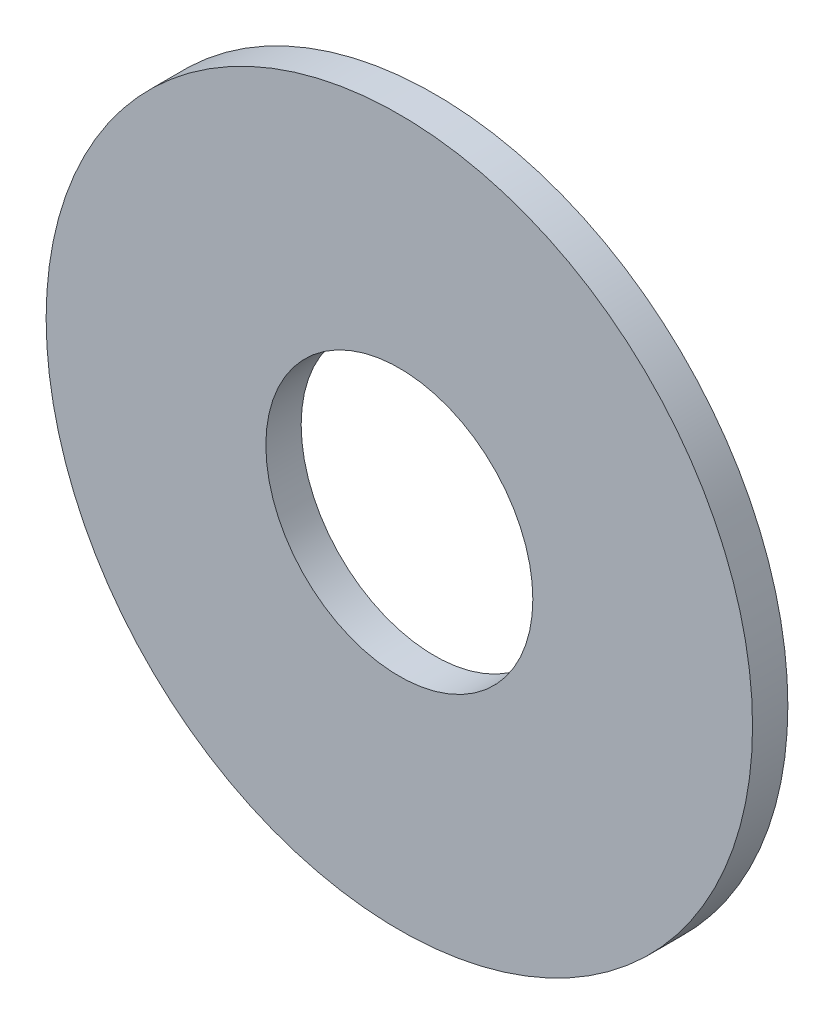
ISO-10303-21;
HEADER;
FILE_DESCRIPTION(('STEP AP214'),'2;1');
FILE_NAME('part.step','',(''),(''),'','','');
FILE_SCHEMA(('AUTOMOTIVE_DESIGN { 1 0 10303 214 1 1 1 1 }'));
ENDSEC;
DATA;
#1=APPLICATION_CONTEXT('core data for automotive mechanical design processes');
#2=APPLICATION_PROTOCOL_DEFINITION('international standard','automotive_design',2000,#1);
#3=PRODUCT_CONTEXT('',#1,'mechanical');
#4=PRODUCT('Part','Part','',(#3));
#5=PRODUCT_RELATED_PRODUCT_CATEGORY('part','',(#4));
#6=PRODUCT_DEFINITION_FORMATION('','',#4);
#7=PRODUCT_DEFINITION_CONTEXT('part definition',#1,'design');
#8=PRODUCT_DEFINITION('design','',#6,#7);
#9=PRODUCT_DEFINITION_SHAPE('','',#8);
#10=(LENGTH_UNIT() NAMED_UNIT(*) SI_UNIT(.MILLI.,.METRE.));
#11=(NAMED_UNIT(*) PLANE_ANGLE_UNIT() SI_UNIT($,.RADIAN.));
#12=(NAMED_UNIT(*) SI_UNIT($,.STERADIAN.) SOLID_ANGLE_UNIT());
#13=UNCERTAINTY_MEASURE_WITH_UNIT(LENGTH_MEASURE(1.E-05),#10,'distance_accuracy_value','');
#14=(GEOMETRIC_REPRESENTATION_CONTEXT(3) GLOBAL_UNCERTAINTY_ASSIGNED_CONTEXT((#13)) GLOBAL_UNIT_ASSIGNED_CONTEXT((#10,
#11,#12)) REPRESENTATION_CONTEXT('',''));
#15=CARTESIAN_POINT('',(0.,0.,0.));
#16=DIRECTION('',(0.,0.,1.));
#17=DIRECTION('',(1.,0.,0.));
#18=AXIS2_PLACEMENT_3D('',#15,#16,#17);
#19=CARTESIAN_POINT('',(0.,0.,3.5));
#20=DIRECTION('',(0.,0.,1.));
#21=DIRECTION('',(1.,0.,0.));
#22=AXIS2_PLACEMENT_3D('',#19,#20,#21);
#23=PLANE('',#22);
#24=CARTESIAN_POINT('',(0.,0.,3.5));
#25=DIRECTION('',(0.,0.,1.));
#26=DIRECTION('',(1.,0.,0.));
#27=AXIS2_PLACEMENT_3D('',#24,#25,#26);
#28=CIRCLE('',#27,35.);
#29=CARTESIAN_POINT('',(35.,0.,3.5));
#30=VERTEX_POINT('',#29);
#31=EDGE_CURVE('E10',#30,#30,#28,.T.);
#32=ORIENTED_EDGE('',*,*,#31,.T.);
#33=EDGE_LOOP('',(#32));
#34=FACE_BOUND('',#33,.T.);
#35=CARTESIAN_POINT('',(0.,0.,3.5));
#36=DIRECTION('',(0.,0.,1.));
#37=DIRECTION('',(1.,0.,0.));
#38=AXIS2_PLACEMENT_3D('',#35,#36,#37);
#39=CIRCLE('',#38,13.2279404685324);
#40=CARTESIAN_POINT('',(13.2279404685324,0.,3.5));
#41=VERTEX_POINT('',#40);
#42=EDGE_CURVE('E40',#41,#41,#39,.T.);
#43=ORIENTED_EDGE('',*,*,#42,.F.);
#44=EDGE_LOOP('',(#43));
#45=FACE_BOUND('',#44,.T.);
#46=ADVANCED_FACE('F29',(#34,#45),#23,.T.);
#47=CARTESIAN_POINT('',(0.,0.,0.));
#48=DIRECTION('',(0.,0.,1.));
#49=DIRECTION('',(1.,0.,0.));
#50=AXIS2_PLACEMENT_3D('',#47,#48,#49);
#51=PLANE('',#50);
#52=CARTESIAN_POINT('',(0.,0.,0.));
#53=DIRECTION('',(0.,0.,1.));
#54=DIRECTION('',(1.,0.,0.));
#55=AXIS2_PLACEMENT_3D('',#52,#53,#54);
#56=CIRCLE('',#55,35.);
#57=CARTESIAN_POINT('',(35.,0.,0.));
#58=VERTEX_POINT('',#57);
#59=EDGE_CURVE('E36',#58,#58,#56,.T.);
#60=ORIENTED_EDGE('',*,*,#59,.F.);
#61=EDGE_LOOP('',(#60));
#62=FACE_BOUND('',#61,.T.);
#63=CARTESIAN_POINT('',(0.,0.,0.));
#64=DIRECTION('',(0.,0.,1.));
#65=DIRECTION('',(1.,0.,0.));
#66=AXIS2_PLACEMENT_3D('',#63,#64,#65);
#67=CIRCLE('',#66,13.2279404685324);
#68=CARTESIAN_POINT('',(13.2279404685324,0.,0.));
#69=VERTEX_POINT('',#68);
#70=EDGE_CURVE('E44',#69,#69,#67,.T.);
#71=ORIENTED_EDGE('',*,*,#70,.T.);
#72=EDGE_LOOP('',(#71));
#73=FACE_BOUND('',#72,.T.);
#74=ADVANCED_FACE('F50',(#62,#73),#51,.F.);
#75=CARTESIAN_POINT('',(0.,0.,3.5));
#76=DIRECTION('',(0.,0.,-1.));
#77=DIRECTION('',(-1.,0.,0.));
#78=AXIS2_PLACEMENT_3D('',#75,#76,#77);
#79=CYLINDRICAL_SURFACE('',#78,35.);
#80=ORIENTED_EDGE('',*,*,#31,.F.);
#81=EDGE_LOOP('',(#80));
#82=FACE_BOUND('',#81,.T.);
#83=ORIENTED_EDGE('',*,*,#59,.T.);
#84=EDGE_LOOP('',(#83));
#85=FACE_BOUND('',#84,.T.);
#86=ADVANCED_FACE('F31',(#82,#85),#79,.T.);
#87=CARTESIAN_POINT('',(0.,0.,3.5));
#88=DIRECTION('',(0.,0.,-1.));
#89=DIRECTION('',(-1.,0.,0.));
#90=AXIS2_PLACEMENT_3D('',#87,#88,#89);
#91=CYLINDRICAL_SURFACE('',#90,13.2279404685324);
#92=ORIENTED_EDGE('',*,*,#42,.T.);
#93=EDGE_LOOP('',(#92));
#94=FACE_BOUND('',#93,.T.);
#95=ORIENTED_EDGE('',*,*,#70,.F.);
#96=EDGE_LOOP('',(#95));
#97=FACE_BOUND('',#96,.T.);
#98=ADVANCED_FACE('F52',(#94,#97),#91,.F.);
#99=CLOSED_SHELL('',(#46,#74,#86,#98));
#100=MANIFOLD_SOLID_BREP('B2',#99);
#101=ADVANCED_BREP_SHAPE_REPRESENTATION('',(#18,#100),#14);
#102=SHAPE_DEFINITION_REPRESENTATION(#9,#101);
ENDSEC;
END-ISO-10303-21;
